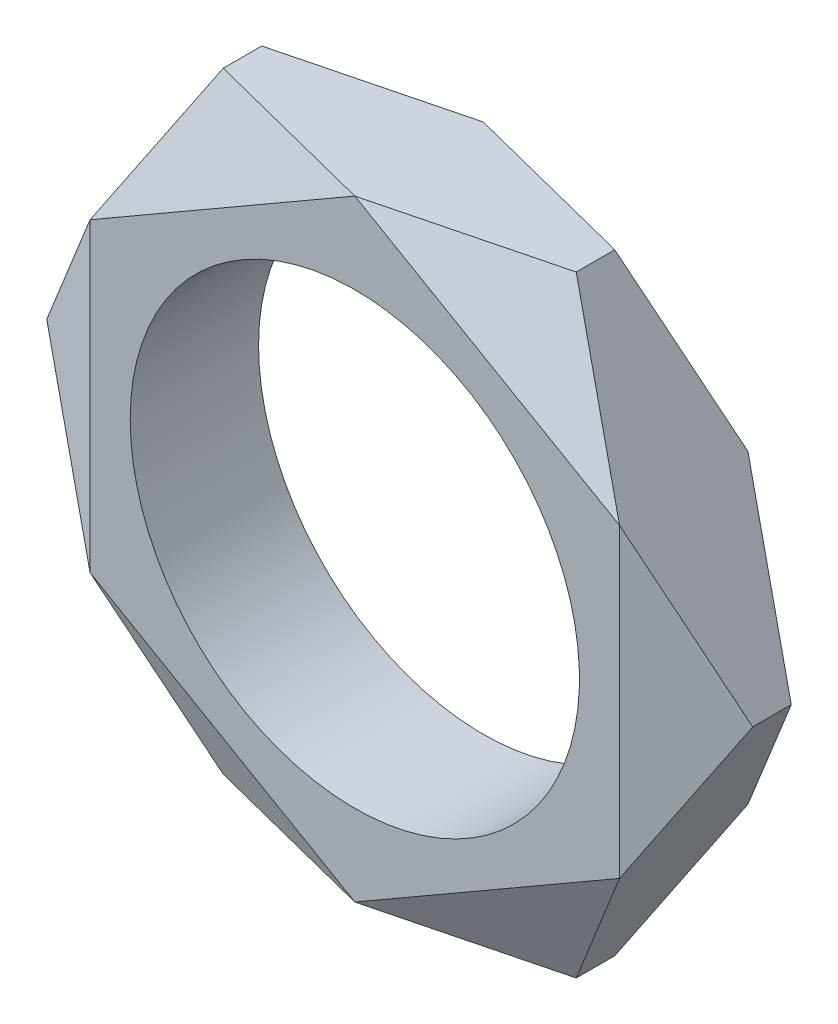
ISO-10303-21;
HEADER;
FILE_DESCRIPTION(('STEP AP214'),'2;1');
FILE_NAME('part.step','',(''),(''),'','','');
FILE_SCHEMA(('AUTOMOTIVE_DESIGN { 1 0 10303 214 1 1 1 1 }'));
ENDSEC;
DATA;
#1=APPLICATION_CONTEXT('core data for automotive mechanical design processes');
#2=APPLICATION_PROTOCOL_DEFINITION('international standard','automotive_design',2000,#1);
#3=PRODUCT_CONTEXT('',#1,'mechanical');
#4=PRODUCT('Part','Part','',(#3));
#5=PRODUCT_RELATED_PRODUCT_CATEGORY('part','',(#4));
#6=PRODUCT_DEFINITION_FORMATION('','',#4);
#7=PRODUCT_DEFINITION_CONTEXT('part definition',#1,'design');
#8=PRODUCT_DEFINITION('design','',#6,#7);
#9=PRODUCT_DEFINITION_SHAPE('','',#8);
#10=(LENGTH_UNIT() NAMED_UNIT(*) SI_UNIT(.MILLI.,.METRE.));
#11=(NAMED_UNIT(*) PLANE_ANGLE_UNIT() SI_UNIT($,.RADIAN.));
#12=(NAMED_UNIT(*) SI_UNIT($,.STERADIAN.) SOLID_ANGLE_UNIT());
#13=UNCERTAINTY_MEASURE_WITH_UNIT(LENGTH_MEASURE(1.E-05),#10,'distance_accuracy_value','');
#14=(GEOMETRIC_REPRESENTATION_CONTEXT(3) GLOBAL_UNCERTAINTY_ASSIGNED_CONTEXT((#13)) GLOBAL_UNIT_ASSIGNED_CONTEXT((#10,
#11,#12)) REPRESENTATION_CONTEXT('',''));
#15=CARTESIAN_POINT('',(0.,0.,0.));
#16=DIRECTION('',(0.,0.,1.));
#17=DIRECTION('',(1.,0.,0.));
#18=AXIS2_PLACEMENT_3D('',#15,#16,#17);
#19=CARTESIAN_POINT('',(2.74999999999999,4.76313972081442,2.));
#20=DIRECTION('',(0.,-1.,0.));
#21=DIRECTION('',(1.,0.,0.));
#22=AXIS2_PLACEMENT_3D('',#19,#20,#21);
#23=PLANE('',#22);
#24=DIRECTION('',(0.,0.,-1.));
#25=VECTOR('',#24,1.);
#26=CARTESIAN_POINT('',(2.74999999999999,4.76313972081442,2.));
#27=LINE('',#26,#25);
#28=CARTESIAN_POINT('',(2.74999999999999,4.76313972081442,1.3));
#29=VERTEX_POINT('',#28);
#30=CARTESIAN_POINT('',(2.74999999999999,4.76313972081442,0.7));
#31=VERTEX_POINT('',#30);
#32=EDGE_CURVE('E128',#29,#31,#27,.T.);
#33=ORIENTED_EDGE('',*,*,#32,.T.);
#34=DIRECTION('',(-0.969097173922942,0.,-0.246679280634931));
#35=VECTOR('',#34,1.);
#36=CARTESIAN_POINT('',(3.06077305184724,4.76313972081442,0.779105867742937));
#37=LINE('',#36,#35);
#38=CARTESIAN_POINT('',(0.,4.76313972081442,0.));
#39=VERTEX_POINT('',#38);
#40=EDGE_CURVE('E11',#31,#39,#37,.T.);
#41=ORIENTED_EDGE('',*,*,#40,.T.);
#42=DIRECTION('',(0.969097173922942,0.,-0.246679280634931));
#43=VECTOR('',#42,1.);
#44=CARTESIAN_POINT('',(2.10454827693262,4.76313972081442,-0.535703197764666));
#45=LINE('',#44,#43);
#46=CARTESIAN_POINT('',(-2.75,4.76313972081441,0.7));
#47=VERTEX_POINT('',#46);
#48=EDGE_CURVE('E228',#47,#39,#45,.T.);
#49=ORIENTED_EDGE('',*,*,#48,.F.);
#50=DIRECTION('',(0.,0.,-1.));
#51=VECTOR('',#50,1.);
#52=CARTESIAN_POINT('',(-2.75,4.76313972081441,2.));
#53=LINE('',#52,#51);
#54=CARTESIAN_POINT('',(-2.75,4.76313972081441,1.3));
#55=VERTEX_POINT('',#54);
#56=EDGE_CURVE('E136',#55,#47,#53,.T.);
#57=ORIENTED_EDGE('',*,*,#56,.F.);
#58=DIRECTION('',(-0.969097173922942,0.,-0.246679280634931));
#59=VECTOR('',#58,1.);
#60=CARTESIAN_POINT('',(2.58266066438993,4.76313972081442,2.6574045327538));
#61=LINE('',#60,#59);
#62=CARTESIAN_POINT('',(0.,4.76313972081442,2.));
#63=VERTEX_POINT('',#62);
#64=EDGE_CURVE('E169',#63,#55,#61,.T.);
#65=ORIENTED_EDGE('',*,*,#64,.F.);
#66=DIRECTION('',(-0.969097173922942,0.,0.246679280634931));
#67=VECTOR('',#66,1.);
#68=CARTESIAN_POINT('',(2.58266066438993,4.76313972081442,1.3425954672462));
#69=LINE('',#68,#67);
#70=EDGE_CURVE('E134',#29,#63,#69,.T.);
#71=ORIENTED_EDGE('',*,*,#70,.F.);
#72=EDGE_LOOP('',(#33,#41,#49,#57,#65,#71));
#73=FACE_BOUND('',#72,.T.);
#74=ADVANCED_FACE('F31',(#73),#23,.F.);
#75=CARTESIAN_POINT('',(2.74999999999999,4.76313972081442,2.));
#76=DIRECTION('',(-0.866025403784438,-0.500000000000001,0.));
#77=DIRECTION('',(0.500000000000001,-0.866025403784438,0.));
#78=AXIS2_PLACEMENT_3D('',#75,#76,#77);
#79=PLANE('',#78);
#80=DIRECTION('',(0.484548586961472,-0.839262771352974,0.246679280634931));
#81=VECTOR('',#80,1.);
#82=CARTESIAN_POINT('',(3.07272586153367,4.20416213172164,-0.535703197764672));
#83=LINE('',#82,#81);
#84=CARTESIAN_POINT('',(4.125,2.3815698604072,0.));
#85=VERTEX_POINT('',#84);
#86=CARTESIAN_POINT('',(5.5,0.,0.7));
#87=VERTEX_POINT('',#86);
#88=EDGE_CURVE('E131',#85,#87,#83,.T.);
#89=ORIENTED_EDGE('',*,*,#88,.F.);
#90=DIRECTION('',(-0.484548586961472,0.839262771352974,0.246679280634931));
#91=VECTOR('',#90,1.);
#92=CARTESIAN_POINT('',(2.59461347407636,5.03227707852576,0.779105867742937));
#93=LINE('',#92,#91);
#94=EDGE_CURVE('E39',#85,#31,#93,.T.);
#95=ORIENTED_EDGE('',*,*,#94,.T.);
#96=ORIENTED_EDGE('',*,*,#32,.F.);
#97=DIRECTION('',(-0.484548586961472,0.839262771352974,-0.246679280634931));
#98=VECTOR('',#97,1.);
#99=CARTESIAN_POINT('',(2.83366966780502,4.6182196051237,1.3425954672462));
#100=LINE('',#99,#98);
#101=CARTESIAN_POINT('',(4.12499999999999,2.38156986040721,2.));
#102=VERTEX_POINT('',#101);
#103=EDGE_CURVE('E178',#102,#29,#100,.T.);
#104=ORIENTED_EDGE('',*,*,#103,.F.);
#105=DIRECTION('',(-0.484548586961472,0.839262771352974,0.246679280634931));
#106=VECTOR('',#105,1.);
#107=CARTESIAN_POINT('',(2.83366966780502,4.6182196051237,2.65740453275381));
#108=LINE('',#107,#106);
#109=CARTESIAN_POINT('',(5.5,0.,1.3));
#110=VERTEX_POINT('',#109);
#111=EDGE_CURVE('E187',#110,#102,#108,.T.);
#112=ORIENTED_EDGE('',*,*,#111,.F.);
#113=DIRECTION('',(0.,0.,-1.));
#114=VECTOR('',#113,1.);
#115=CARTESIAN_POINT('',(5.5,0.,2.));
#116=LINE('',#115,#114);
#117=EDGE_CURVE('E135',#110,#87,#116,.T.);
#118=ORIENTED_EDGE('',*,*,#117,.T.);
#119=EDGE_LOOP('',(#89,#95,#96,#104,#112,#118));
#120=FACE_BOUND('',#119,.T.);
#121=ADVANCED_FACE('F126',(#120),#79,.F.);
#122=CARTESIAN_POINT('',(5.5,0.,0.));
#123=DIRECTION('',(0.,0.,-1.));
#124=DIRECTION('',(-1.,0.,0.));
#125=AXIS2_PLACEMENT_3D('',#122,#123,#124);
#126=PLANE('',#125);
#127=DIRECTION('',(-0.866025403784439,0.499999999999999,0.));
#128=VECTOR('',#127,1.);
#129=CARTESIAN_POINT('',(6.1875,1.19078493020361,0.));
#130=LINE('',#129,#128);
#131=EDGE_CURVE('E46',#85,#39,#130,.T.);
#132=ORIENTED_EDGE('',*,*,#131,.F.);
#133=DIRECTION('',(0.,-1.,0.));
#134=VECTOR('',#133,1.);
#135=CARTESIAN_POINT('',(4.125,0.,0.));
#136=LINE('',#135,#134);
#137=CARTESIAN_POINT('',(4.125,-2.38156986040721,0.));
#138=VERTEX_POINT('',#137);
#139=EDGE_CURVE('E197',#85,#138,#136,.T.);
#140=ORIENTED_EDGE('',*,*,#139,.T.);
#141=DIRECTION('',(-0.866025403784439,-0.499999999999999,0.));
#142=VECTOR('',#141,1.);
#143=CARTESIAN_POINT('',(6.1875,-1.19078493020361,0.));
#144=LINE('',#143,#142);
#145=CARTESIAN_POINT('',(0.,-4.76313972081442,0.));
#146=VERTEX_POINT('',#145);
#147=EDGE_CURVE('E200',#138,#146,#144,.T.);
#148=ORIENTED_EDGE('',*,*,#147,.T.);
#149=DIRECTION('',(-0.866025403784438,0.500000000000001,0.));
#150=VECTOR('',#149,1.);
#151=CARTESIAN_POINT('',(2.06249999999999,-5.95392465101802,0.));
#152=LINE('',#151,#150);
#153=CARTESIAN_POINT('',(-4.125,-2.38156986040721,0.));
#154=VERTEX_POINT('',#153);
#155=EDGE_CURVE('E209',#146,#154,#152,.T.);
#156=ORIENTED_EDGE('',*,*,#155,.T.);
#157=DIRECTION('',(0.,1.,0.));
#158=VECTOR('',#157,1.);
#159=CARTESIAN_POINT('',(-4.125,0.,0.));
#160=LINE('',#159,#158);
#161=CARTESIAN_POINT('',(-4.125,2.3815698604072,0.));
#162=VERTEX_POINT('',#161);
#163=EDGE_CURVE('E218',#154,#162,#160,.T.);
#164=ORIENTED_EDGE('',*,*,#163,.T.);
#165=DIRECTION('',(0.866025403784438,0.500000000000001,0.));
#166=VECTOR('',#165,1.);
#167=CARTESIAN_POINT('',(2.06249999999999,5.95392465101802,0.));
#168=LINE('',#167,#166);
#169=EDGE_CURVE('E226',#162,#39,#168,.T.);
#170=ORIENTED_EDGE('',*,*,#169,.T.);
#171=EDGE_LOOP('',(#132,#140,#148,#156,#164,#170));
#172=FACE_BOUND('',#171,.T.);
#173=CARTESIAN_POINT('',(0.,0.,0.));
#174=DIRECTION('',(0.,0.,-1.));
#175=DIRECTION('',(-1.,0.,0.));
#176=AXIS2_PLACEMENT_3D('',#173,#174,#175);
#177=CIRCLE('',#176,3.5);
#178=CARTESIAN_POINT('',(-3.5,0.,0.));
#179=VERTEX_POINT('',#178);
#180=EDGE_CURVE('E285',#179,#179,#177,.T.);
#181=ORIENTED_EDGE('',*,*,#180,.F.);
#182=EDGE_LOOP('',(#181));
#183=FACE_BOUND('',#182,.T.);
#184=ADVANCED_FACE('F236',(#172,#183),#126,.T.);
#185=CARTESIAN_POINT('',(2.74999999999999,-4.76313972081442,2.));
#186=DIRECTION('',(-0.866025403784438,0.500000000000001,0.));
#187=DIRECTION('',(-0.500000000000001,-0.866025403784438,0.));
#188=AXIS2_PLACEMENT_3D('',#185,#186,#187);
#189=PLANE('',#188);
#190=DIRECTION('',(-0.484548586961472,-0.839262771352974,0.246679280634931));
#191=VECTOR('',#190,1.);
#192=CARTESIAN_POINT('',(2.59461347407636,-5.03227707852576,0.779105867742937));
#193=LINE('',#192,#191);
#194=CARTESIAN_POINT('',(2.74999999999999,-4.76313972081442,0.7));
#195=VERTEX_POINT('',#194);
#196=EDGE_CURVE('E203',#138,#195,#193,.T.);
#197=ORIENTED_EDGE('',*,*,#196,.F.);
#198=DIRECTION('',(-0.484548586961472,-0.839262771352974,-0.246679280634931));
#199=VECTOR('',#198,1.);
#200=CARTESIAN_POINT('',(3.07272586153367,-4.20416213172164,-0.535703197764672));
#201=LINE('',#200,#199);
#202=EDGE_CURVE('E193',#87,#138,#201,.T.);
#203=ORIENTED_EDGE('',*,*,#202,.F.);
#204=ORIENTED_EDGE('',*,*,#117,.F.);
#205=DIRECTION('',(0.484548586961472,0.839262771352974,-0.246679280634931));
#206=VECTOR('',#205,1.);
#207=CARTESIAN_POINT('',(2.83366966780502,-4.6182196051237,2.65740453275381));
#208=LINE('',#207,#206);
#209=CARTESIAN_POINT('',(4.125,-2.38156986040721,2.));
#210=VERTEX_POINT('',#209);
#211=EDGE_CURVE('E184',#210,#110,#208,.T.);
#212=ORIENTED_EDGE('',*,*,#211,.F.);
#213=DIRECTION('',(0.484548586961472,0.839262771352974,0.246679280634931));
#214=VECTOR('',#213,1.);
#215=CARTESIAN_POINT('',(2.83366966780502,-4.6182196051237,1.3425954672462));
#216=LINE('',#215,#214);
#217=CARTESIAN_POINT('',(2.74999999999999,-4.76313972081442,1.3));
#218=VERTEX_POINT('',#217);
#219=EDGE_CURVE('E138',#218,#210,#216,.T.);
#220=ORIENTED_EDGE('',*,*,#219,.F.);
#221=DIRECTION('',(0.,0.,-1.));
#222=VECTOR('',#221,1.);
#223=CARTESIAN_POINT('',(2.74999999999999,-4.76313972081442,2.));
#224=LINE('',#223,#222);
#225=EDGE_CURVE('E277',#218,#195,#224,.T.);
#226=ORIENTED_EDGE('',*,*,#225,.T.);
#227=EDGE_LOOP('',(#197,#203,#204,#212,#220,#226));
#228=FACE_BOUND('',#227,.T.);
#229=ADVANCED_FACE('F33',(#228),#189,.F.);
#230=CARTESIAN_POINT('',(-2.75,4.76313972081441,2.));
#231=DIRECTION('',(0.866025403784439,-0.5,0.));
#232=DIRECTION('',(0.5,0.866025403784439,0.));
#233=AXIS2_PLACEMENT_3D('',#230,#231,#232);
#234=PLANE('',#233);
#235=DIRECTION('',(0.484548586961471,0.839262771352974,0.246679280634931));
#236=VECTOR('',#235,1.);
#237=CARTESIAN_POINT('',(-2.59461347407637,5.03227707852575,0.779105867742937));
#238=LINE('',#237,#236);
#239=EDGE_CURVE('E53',#162,#47,#238,.T.);
#240=ORIENTED_EDGE('',*,*,#239,.F.);
#241=DIRECTION('',(0.484548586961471,0.839262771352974,-0.246679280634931));
#242=VECTOR('',#241,1.);
#243=CARTESIAN_POINT('',(-3.07272586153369,4.20416213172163,-0.535703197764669));
#244=LINE('',#243,#242);
#245=CARTESIAN_POINT('',(-5.5,0.,0.7));
#246=VERTEX_POINT('',#245);
#247=EDGE_CURVE('E220',#246,#162,#244,.T.);
#248=ORIENTED_EDGE('',*,*,#247,.F.);
#249=DIRECTION('',(0.,0.,-1.));
#250=VECTOR('',#249,1.);
#251=CARTESIAN_POINT('',(-5.5,0.,2.));
#252=LINE('',#251,#250);
#253=CARTESIAN_POINT('',(-5.5,0.,1.3));
#254=VERTEX_POINT('',#253);
#255=EDGE_CURVE('E140',#254,#246,#252,.T.);
#256=ORIENTED_EDGE('',*,*,#255,.F.);
#257=DIRECTION('',(-0.484548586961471,-0.839262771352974,-0.246679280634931));
#258=VECTOR('',#257,1.);
#259=CARTESIAN_POINT('',(-2.83366966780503,4.61821960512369,2.6574045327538));
#260=LINE('',#259,#258);
#261=CARTESIAN_POINT('',(-4.125,2.3815698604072,2.));
#262=VERTEX_POINT('',#261);
#263=EDGE_CURVE('E160',#262,#254,#260,.T.);
#264=ORIENTED_EDGE('',*,*,#263,.F.);
#265=DIRECTION('',(-0.484548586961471,-0.839262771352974,0.246679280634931));
#266=VECTOR('',#265,1.);
#267=CARTESIAN_POINT('',(-2.83366966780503,4.61821960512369,1.3425954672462));
#268=LINE('',#267,#266);
#269=EDGE_CURVE('E172',#55,#262,#268,.T.);
#270=ORIENTED_EDGE('',*,*,#269,.F.);
#271=ORIENTED_EDGE('',*,*,#56,.T.);
#272=EDGE_LOOP('',(#240,#248,#256,#264,#270,#271));
#273=FACE_BOUND('',#272,.T.);
#274=ADVANCED_FACE('F244',(#273),#234,.F.);
#275=CARTESIAN_POINT('',(-5.5,0.,2.));
#276=DIRECTION('',(0.866025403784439,0.5,0.));
#277=DIRECTION('',(-0.5,0.866025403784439,0.));
#278=AXIS2_PLACEMENT_3D('',#275,#276,#277);
#279=PLANE('',#278);
#280=DIRECTION('',(-0.484548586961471,0.839262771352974,0.246679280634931));
#281=VECTOR('',#280,1.);
#282=CARTESIAN_POINT('',(-5.65538652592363,0.269137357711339,0.779105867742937));
#283=LINE('',#282,#281);
#284=EDGE_CURVE('E223',#154,#246,#283,.T.);
#285=ORIENTED_EDGE('',*,*,#284,.F.);
#286=DIRECTION('',(-0.484548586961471,0.839262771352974,-0.246679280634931));
#287=VECTOR('',#286,1.);
#288=CARTESIAN_POINT('',(-5.17727413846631,-0.558977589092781,-0.535703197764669));
#289=LINE('',#288,#287);
#290=CARTESIAN_POINT('',(-2.75,-4.76313972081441,0.7));
#291=VERTEX_POINT('',#290);
#292=EDGE_CURVE('E212',#291,#154,#289,.T.);
#293=ORIENTED_EDGE('',*,*,#292,.F.);
#294=DIRECTION('',(0.,0.,-1.));
#295=VECTOR('',#294,1.);
#296=CARTESIAN_POINT('',(-2.75,-4.76313972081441,2.));
#297=LINE('',#296,#295);
#298=CARTESIAN_POINT('',(-2.75,-4.76313972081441,1.3));
#299=VERTEX_POINT('',#298);
#300=EDGE_CURVE('E247',#299,#291,#297,.T.);
#301=ORIENTED_EDGE('',*,*,#300,.F.);
#302=DIRECTION('',(0.484548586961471,-0.839262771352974,-0.246679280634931));
#303=VECTOR('',#302,1.);
#304=CARTESIAN_POINT('',(-5.41633033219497,-0.144920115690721,2.6574045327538));
#305=LINE('',#304,#303);
#306=CARTESIAN_POINT('',(-4.125,-2.38156986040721,2.));
#307=VERTEX_POINT('',#306);
#308=EDGE_CURVE('E151',#307,#299,#305,.T.);
#309=ORIENTED_EDGE('',*,*,#308,.F.);
#310=DIRECTION('',(0.484548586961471,-0.839262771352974,0.246679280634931));
#311=VECTOR('',#310,1.);
#312=CARTESIAN_POINT('',(-5.41633033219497,-0.144920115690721,1.3425954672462));
#313=LINE('',#312,#311);
#314=EDGE_CURVE('E163',#254,#307,#313,.T.);
#315=ORIENTED_EDGE('',*,*,#314,.F.);
#316=ORIENTED_EDGE('',*,*,#255,.T.);
#317=EDGE_LOOP('',(#285,#293,#301,#309,#315,#316));
#318=FACE_BOUND('',#317,.T.);
#319=ADVANCED_FACE('F276',(#318),#279,.F.);
#320=CARTESIAN_POINT('',(-2.75,-4.76313972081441,2.));
#321=DIRECTION('',(0.,1.,0.));
#322=DIRECTION('',(-1.,0.,0.));
#323=AXIS2_PLACEMENT_3D('',#320,#321,#322);
#324=PLANE('',#323);
#325=DIRECTION('',(-0.969097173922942,0.,0.246679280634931));
#326=VECTOR('',#325,1.);
#327=CARTESIAN_POINT('',(-3.06077305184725,-4.76313972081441,0.779105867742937));
#328=LINE('',#327,#326);
#329=EDGE_CURVE('E215',#146,#291,#328,.T.);
#330=ORIENTED_EDGE('',*,*,#329,.F.);
#331=DIRECTION('',(-0.969097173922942,0.,-0.246679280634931));
#332=VECTOR('',#331,1.);
#333=CARTESIAN_POINT('',(-2.10454827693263,-4.76313972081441,-0.535703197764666));
#334=LINE('',#333,#332);
#335=EDGE_CURVE('E206',#195,#146,#334,.T.);
#336=ORIENTED_EDGE('',*,*,#335,.F.);
#337=ORIENTED_EDGE('',*,*,#225,.F.);
#338=DIRECTION('',(0.969097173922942,0.,-0.246679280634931));
#339=VECTOR('',#338,1.);
#340=CARTESIAN_POINT('',(-2.58266066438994,-4.76313972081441,2.6574045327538));
#341=LINE('',#340,#339);
#342=CARTESIAN_POINT('',(0.,-4.76313972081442,2.));
#343=VERTEX_POINT('',#342);
#344=EDGE_CURVE('E145',#343,#218,#341,.T.);
#345=ORIENTED_EDGE('',*,*,#344,.F.);
#346=DIRECTION('',(0.969097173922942,0.,0.246679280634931));
#347=VECTOR('',#346,1.);
#348=CARTESIAN_POINT('',(-2.58266066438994,-4.76313972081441,1.3425954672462));
#349=LINE('',#348,#347);
#350=EDGE_CURVE('E154',#299,#343,#349,.T.);
#351=ORIENTED_EDGE('',*,*,#350,.F.);
#352=ORIENTED_EDGE('',*,*,#300,.T.);
#353=EDGE_LOOP('',(#330,#336,#337,#345,#351,#352));
#354=FACE_BOUND('',#353,.T.);
#355=ADVANCED_FACE('F273',(#354),#324,.F.);
#356=CARTESIAN_POINT('',(5.5,0.,2.));
#357=DIRECTION('',(0.,0.,-1.));
#358=DIRECTION('',(-1.,0.,0.));
#359=AXIS2_PLACEMENT_3D('',#356,#357,#358);
#360=PLANE('',#359);
#361=DIRECTION('',(0.,-1.,0.));
#362=VECTOR('',#361,1.);
#363=CARTESIAN_POINT('',(4.125,0.,2.));
#364=LINE('',#363,#362);
#365=EDGE_CURVE('E190',#102,#210,#364,.T.);
#366=ORIENTED_EDGE('',*,*,#365,.F.);
#367=DIRECTION('',(0.866025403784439,-0.499999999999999,0.));
#368=VECTOR('',#367,1.);
#369=CARTESIAN_POINT('',(6.1875,1.19078493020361,2.));
#370=LINE('',#369,#368);
#371=EDGE_CURVE('E181',#63,#102,#370,.T.);
#372=ORIENTED_EDGE('',*,*,#371,.F.);
#373=DIRECTION('',(0.866025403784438,0.500000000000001,0.));
#374=VECTOR('',#373,1.);
#375=CARTESIAN_POINT('',(2.06249999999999,5.95392465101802,2.));
#376=LINE('',#375,#374);
#377=EDGE_CURVE('E175',#262,#63,#376,.T.);
#378=ORIENTED_EDGE('',*,*,#377,.F.);
#379=DIRECTION('',(0.,1.,0.));
#380=VECTOR('',#379,1.);
#381=CARTESIAN_POINT('',(-4.125,0.,2.));
#382=LINE('',#381,#380);
#383=EDGE_CURVE('E166',#307,#262,#382,.T.);
#384=ORIENTED_EDGE('',*,*,#383,.F.);
#385=DIRECTION('',(-0.866025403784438,0.500000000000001,0.));
#386=VECTOR('',#385,1.);
#387=CARTESIAN_POINT('',(2.06249999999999,-5.95392465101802,2.));
#388=LINE('',#387,#386);
#389=EDGE_CURVE('E157',#343,#307,#388,.T.);
#390=ORIENTED_EDGE('',*,*,#389,.F.);
#391=DIRECTION('',(-0.866025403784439,-0.499999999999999,0.));
#392=VECTOR('',#391,1.);
#393=CARTESIAN_POINT('',(6.1875,-1.19078493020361,2.));
#394=LINE('',#393,#392);
#395=EDGE_CURVE('E148',#210,#343,#394,.T.);
#396=ORIENTED_EDGE('',*,*,#395,.F.);
#397=EDGE_LOOP('',(#366,#372,#378,#384,#390,#396));
#398=FACE_BOUND('',#397,.T.);
#399=CARTESIAN_POINT('',(0.,0.,2.));
#400=DIRECTION('',(0.,0.,-1.));
#401=DIRECTION('',(-1.,0.,0.));
#402=AXIS2_PLACEMENT_3D('',#399,#400,#401);
#403=CIRCLE('',#402,3.5);
#404=CARTESIAN_POINT('',(-3.5,0.,2.));
#405=VERTEX_POINT('',#404);
#406=EDGE_CURVE('E280',#405,#405,#403,.F.);
#407=ORIENTED_EDGE('',*,*,#406,.F.);
#408=EDGE_LOOP('',(#407));
#409=FACE_BOUND('',#408,.T.);
#410=ADVANCED_FACE('F264',(#398,#409),#360,.F.);
#411=CARTESIAN_POINT('',(0.,0.,11.8994949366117));
#412=DIRECTION('',(0.,0.,-1.));
#413=DIRECTION('',(-1.,0.,0.));
#414=AXIS2_PLACEMENT_3D('',#411,#412,#413);
#415=CYLINDRICAL_SURFACE('',#414,3.5);
#416=CARTESIAN_POINT('',(-3.5,0.,2.));
#417=CARTESIAN_POINT('',(-3.5,0.,1.97916666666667));
#418=CARTESIAN_POINT('',(-3.5,0.,1.95833333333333));
#419=CARTESIAN_POINT('',(-3.5,0.,1.91666666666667));
#420=CARTESIAN_POINT('',(-3.5,0.,1.89583333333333));
#421=CARTESIAN_POINT('',(-3.5,0.,1.85416666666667));
#422=CARTESIAN_POINT('',(-3.5,0.,1.83333333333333));
#423=CARTESIAN_POINT('',(-3.5,0.,1.79166666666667));
#424=CARTESIAN_POINT('',(-3.5,0.,1.77083333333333));
#425=CARTESIAN_POINT('',(-3.5,0.,1.72916666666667));
#426=CARTESIAN_POINT('',(-3.5,0.,1.70833333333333));
#427=CARTESIAN_POINT('',(-3.5,0.,1.66666666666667));
#428=CARTESIAN_POINT('',(-3.5,0.,1.64583333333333));
#429=CARTESIAN_POINT('',(-3.5,0.,1.60416666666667));
#430=CARTESIAN_POINT('',(-3.5,0.,1.58333333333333));
#431=CARTESIAN_POINT('',(-3.5,0.,1.54166666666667));
#432=CARTESIAN_POINT('',(-3.5,0.,1.52083333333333));
#433=CARTESIAN_POINT('',(-3.5,0.,1.47916666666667));
#434=CARTESIAN_POINT('',(-3.5,0.,1.45833333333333));
#435=CARTESIAN_POINT('',(-3.5,0.,1.41666666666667));
#436=CARTESIAN_POINT('',(-3.5,0.,1.39583333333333));
#437=CARTESIAN_POINT('',(-3.5,0.,1.35416666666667));
#438=CARTESIAN_POINT('',(-3.5,0.,1.33333333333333));
#439=CARTESIAN_POINT('',(-3.5,0.,1.29166666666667));
#440=CARTESIAN_POINT('',(-3.5,0.,1.27083333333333));
#441=CARTESIAN_POINT('',(-3.5,0.,1.22916666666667));
#442=CARTESIAN_POINT('',(-3.5,0.,1.20833333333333));
#443=CARTESIAN_POINT('',(-3.5,0.,1.16666666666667));
#444=CARTESIAN_POINT('',(-3.5,0.,1.14583333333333));
#445=CARTESIAN_POINT('',(-3.5,0.,1.10416666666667));
#446=CARTESIAN_POINT('',(-3.5,0.,1.08333333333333));
#447=CARTESIAN_POINT('',(-3.5,0.,1.04166666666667));
#448=CARTESIAN_POINT('',(-3.5,0.,1.02083333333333));
#449=CARTESIAN_POINT('',(-3.5,0.,0.979166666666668));
#450=CARTESIAN_POINT('',(-3.5,0.,0.958333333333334));
#451=CARTESIAN_POINT('',(-3.5,0.,0.916666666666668));
#452=CARTESIAN_POINT('',(-3.5,0.,0.895833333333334));
#453=CARTESIAN_POINT('',(-3.5,0.,0.854166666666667));
#454=CARTESIAN_POINT('',(-3.5,0.,0.833333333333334));
#455=CARTESIAN_POINT('',(-3.5,0.,0.791666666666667));
#456=CARTESIAN_POINT('',(-3.5,0.,0.770833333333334));
#457=CARTESIAN_POINT('',(-3.5,0.,0.729166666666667));
#458=CARTESIAN_POINT('',(-3.5,0.,0.708333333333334));
#459=CARTESIAN_POINT('',(-3.5,0.,0.666666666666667));
#460=CARTESIAN_POINT('',(-3.5,0.,0.645833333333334));
#461=CARTESIAN_POINT('',(-3.5,0.,0.604166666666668));
#462=CARTESIAN_POINT('',(-3.5,0.,0.583333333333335));
#463=CARTESIAN_POINT('',(-3.5,0.,0.541666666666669));
#464=CARTESIAN_POINT('',(-3.5,0.,0.520833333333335));
#465=CARTESIAN_POINT('',(-3.5,0.,0.479166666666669));
#466=CARTESIAN_POINT('',(-3.5,0.,0.458333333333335));
#467=CARTESIAN_POINT('',(-3.5,0.,0.416666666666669));
#468=CARTESIAN_POINT('',(-3.5,0.,0.395833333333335));
#469=CARTESIAN_POINT('',(-3.5,0.,0.354166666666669));
#470=CARTESIAN_POINT('',(-3.5,0.,0.333333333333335));
#471=CARTESIAN_POINT('',(-3.5,0.,0.291666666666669));
#472=CARTESIAN_POINT('',(-3.5,0.,0.270833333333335));
#473=CARTESIAN_POINT('',(-3.5,0.,0.229166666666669));
#474=CARTESIAN_POINT('',(-3.5,0.,0.208333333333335));
#475=CARTESIAN_POINT('',(-3.5,0.,0.166666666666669));
#476=CARTESIAN_POINT('',(-3.5,0.,0.145833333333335));
#477=CARTESIAN_POINT('',(-3.5,0.,0.104166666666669));
#478=CARTESIAN_POINT('',(-3.5,0.,0.0833333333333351));
#479=CARTESIAN_POINT('',(-3.5,0.,0.0416666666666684));
#480=CARTESIAN_POINT('',(-3.5,0.,0.0208333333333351));
#481=CARTESIAN_POINT('',(-3.5,0.,0.));
#482=B_SPLINE_CURVE_WITH_KNOTS('',3,(#416,#417,#418,#419,#420,#421,#422,#423,#424,#425,#426,
#427,#428,#429,#430,#431,#432,#433,#434,#435,#436,#437,#438,#439,#440,#441,#442,#443,#444,#445,
#446,#447,#448,#449,#450,#451,#452,#453,#454,#455,#456,#457,#458,#459,#460,#461,#462,#463,#464,
#465,#466,#467,#468,#469,#470,#471,#472,#473,#474,#475,#476,#477,#478,#479,#480,#481),
.UNSPECIFIED.,.F.,.F.,(4,2,2,2,2,2,2,2,2,2,2,2,2,2,2,2,2,2,2,2,2,2,2,2,2,2,2,2,2,2,2,2,4),(0.,
0.0625000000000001,0.125,0.1875,0.25,0.3125,0.375,0.4375,0.5,0.562499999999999,
0.624999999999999,0.687499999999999,0.749999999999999,0.812499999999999,0.874999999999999,
0.937499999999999,0.999999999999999,1.0625,1.125,1.1875,1.25,1.3125,1.375,1.4375,1.5,1.5625,
1.625,1.6875,1.75,1.8125,1.875,1.9375,2.),.UNSPECIFIED.);
#483=EDGE_CURVE('BSEAM289',#405,#179,#482,.T.);
#484=ORIENTED_EDGE('',*,*,#406,.T.);
#485=ORIENTED_EDGE('',*,*,#180,.T.);
#486=ORIENTED_EDGE('',*,*,#483,.T.);
#487=ORIENTED_EDGE('',*,*,#483,.F.);
#488=EDGE_LOOP('',(#484,#486,#485,#487));
#489=FACE_BOUND('',#488,.T.);
#490=ADVANCED_FACE('F289',(#489),#415,.F.);
#491=CARTESIAN_POINT('',(-0.0229166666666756,-4.77107828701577,2.00233333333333));
#492=DIRECTION('',(0.226841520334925,-0.39290103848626,0.891163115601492));
#493=DIRECTION('',(0.,-0.915016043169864,-0.40341745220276));
#494=AXIS2_PLACEMENT_3D('',#491,#492,#493);
#495=PLANE('',#494);
#496=ORIENTED_EDGE('',*,*,#344,.T.);
#497=ORIENTED_EDGE('',*,*,#219,.T.);
#498=ORIENTED_EDGE('',*,*,#395,.T.);
#499=EDGE_LOOP('',(#496,#497,#498));
#500=FACE_BOUND('',#499,.T.);
#501=ADVANCED_FACE('F268',(#500),#495,.T.);
#502=CARTESIAN_POINT('',(-4.14333333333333,-2.36569272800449,2.00233333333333));
#503=DIRECTION('',(-0.226841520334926,-0.39290103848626,0.891163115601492));
#504=DIRECTION('',(0.,-0.915016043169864,-0.40341745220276));
#505=AXIS2_PLACEMENT_3D('',#502,#503,#504);
#506=PLANE('',#505);
#507=ORIENTED_EDGE('',*,*,#389,.T.);
#508=ORIENTED_EDGE('',*,*,#308,.T.);
#509=ORIENTED_EDGE('',*,*,#350,.T.);
#510=EDGE_LOOP('',(#507,#508,#509));
#511=FACE_BOUND('',#510,.T.);
#512=ADVANCED_FACE('F270',(#511),#506,.T.);
#513=CARTESIAN_POINT('',(-4.12041666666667,2.40538555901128,2.00233333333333));
#514=DIRECTION('',(-0.453683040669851,0.,0.891163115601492));
#515=DIRECTION('',(0.891163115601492,0.,0.453683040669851));
#516=AXIS2_PLACEMENT_3D('',#513,#514,#515);
#517=PLANE('',#516);
#518=ORIENTED_EDGE('',*,*,#383,.T.);
#519=ORIENTED_EDGE('',*,*,#263,.T.);
#520=ORIENTED_EDGE('',*,*,#314,.T.);
#521=EDGE_LOOP('',(#518,#519,#520));
#522=FACE_BOUND('',#521,.T.);
#523=ADVANCED_FACE('F249',(#522),#517,.T.);
#524=CARTESIAN_POINT('',(0.0229166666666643,4.77107828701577,2.00233333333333));
#525=DIRECTION('',(-0.226841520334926,0.39290103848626,0.891163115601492));
#526=DIRECTION('',(0.,-0.915016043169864,0.40341745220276));
#527=AXIS2_PLACEMENT_3D('',#524,#525,#526);
#528=PLANE('',#527);
#529=ORIENTED_EDGE('',*,*,#377,.T.);
#530=ORIENTED_EDGE('',*,*,#64,.T.);
#531=ORIENTED_EDGE('',*,*,#269,.T.);
#532=EDGE_LOOP('',(#529,#530,#531));
#533=FACE_BOUND('',#532,.T.);
#534=ADVANCED_FACE('F253',(#533),#528,.T.);
#535=CARTESIAN_POINT('',(4.14333333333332,2.3656927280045,2.00233333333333));
#536=DIRECTION('',(0.226841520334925,0.39290103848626,0.891163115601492));
#537=DIRECTION('',(0.,-0.915016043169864,0.40341745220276));
#538=AXIS2_PLACEMENT_3D('',#535,#536,#537);
#539=PLANE('',#538);
#540=ORIENTED_EDGE('',*,*,#371,.T.);
#541=ORIENTED_EDGE('',*,*,#103,.T.);
#542=ORIENTED_EDGE('',*,*,#70,.T.);
#543=EDGE_LOOP('',(#540,#541,#542));
#544=FACE_BOUND('',#543,.T.);
#545=ADVANCED_FACE('F256',(#544),#539,.T.);
#546=CARTESIAN_POINT('',(4.12041666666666,-2.40538555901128,2.00233333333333));
#547=DIRECTION('',(0.45368304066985,0.,0.891163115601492));
#548=DIRECTION('',(0.891163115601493,0.,-0.45368304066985));
#549=AXIS2_PLACEMENT_3D('',#546,#547,#548);
#550=PLANE('',#549);
#551=ORIENTED_EDGE('',*,*,#365,.T.);
#552=ORIENTED_EDGE('',*,*,#211,.T.);
#553=ORIENTED_EDGE('',*,*,#111,.T.);
#554=EDGE_LOOP('',(#551,#552,#553));
#555=FACE_BOUND('',#554,.T.);
#556=ADVANCED_FACE('F262',(#555),#550,.T.);
#557=CARTESIAN_POINT('',(5.50916666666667,0.,0.704666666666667));
#558=DIRECTION('',(0.45368304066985,0.,-0.891163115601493));
#559=DIRECTION('',(-0.891163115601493,0.,-0.45368304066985));
#560=AXIS2_PLACEMENT_3D('',#557,#558,#559);
#561=PLANE('',#560);
#562=ORIENTED_EDGE('',*,*,#88,.T.);
#563=ORIENTED_EDGE('',*,*,#202,.T.);
#564=ORIENTED_EDGE('',*,*,#139,.F.);
#565=EDGE_LOOP('',(#562,#563,#564));
#566=FACE_BOUND('',#565,.T.);
#567=ADVANCED_FACE('F328',(#566),#561,.T.);
#568=CARTESIAN_POINT('',(2.75458333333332,-4.77107828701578,0.704666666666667));
#569=DIRECTION('',(0.226841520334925,-0.39290103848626,-0.891163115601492));
#570=DIRECTION('',(0.,0.915016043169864,-0.40341745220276));
#571=AXIS2_PLACEMENT_3D('',#568,#569,#570);
#572=PLANE('',#571);
#573=ORIENTED_EDGE('',*,*,#147,.F.);
#574=ORIENTED_EDGE('',*,*,#196,.T.);
#575=ORIENTED_EDGE('',*,*,#335,.T.);
#576=EDGE_LOOP('',(#573,#574,#575));
#577=FACE_BOUND('',#576,.T.);
#578=ADVANCED_FACE('F331',(#577),#572,.T.);
#579=CARTESIAN_POINT('',(-2.75458333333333,-4.77107828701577,0.704666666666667));
#580=DIRECTION('',(-0.226841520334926,-0.392901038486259,-0.891163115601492));
#581=DIRECTION('',(0.,0.915016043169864,-0.40341745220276));
#582=AXIS2_PLACEMENT_3D('',#579,#580,#581);
#583=PLANE('',#582);
#584=ORIENTED_EDGE('',*,*,#155,.F.);
#585=ORIENTED_EDGE('',*,*,#329,.T.);
#586=ORIENTED_EDGE('',*,*,#292,.T.);
#587=EDGE_LOOP('',(#584,#585,#586));
#588=FACE_BOUND('',#587,.T.);
#589=ADVANCED_FACE('F335',(#588),#583,.T.);
#590=CARTESIAN_POINT('',(-5.50916666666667,0.,0.704666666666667));
#591=DIRECTION('',(-0.453683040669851,0.,-0.891163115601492));
#592=DIRECTION('',(-0.891163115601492,0.,0.453683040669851));
#593=AXIS2_PLACEMENT_3D('',#590,#591,#592);
#594=PLANE('',#593);
#595=ORIENTED_EDGE('',*,*,#163,.F.);
#596=ORIENTED_EDGE('',*,*,#284,.T.);
#597=ORIENTED_EDGE('',*,*,#247,.T.);
#598=EDGE_LOOP('',(#595,#596,#597));
#599=FACE_BOUND('',#598,.T.);
#600=ADVANCED_FACE('F242',(#599),#594,.T.);
#601=CARTESIAN_POINT('',(-2.75458333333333,4.77107828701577,0.704666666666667));
#602=DIRECTION('',(-0.226841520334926,0.392901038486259,-0.891163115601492));
#603=DIRECTION('',(0.,0.915016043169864,0.40341745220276));
#604=AXIS2_PLACEMENT_3D('',#601,#602,#603);
#605=PLANE('',#604);
#606=ORIENTED_EDGE('',*,*,#169,.F.);
#607=ORIENTED_EDGE('',*,*,#239,.T.);
#608=ORIENTED_EDGE('',*,*,#48,.T.);
#609=EDGE_LOOP('',(#606,#607,#608));
#610=FACE_BOUND('',#609,.T.);
#611=ADVANCED_FACE('F234',(#610),#605,.T.);
#612=CARTESIAN_POINT('',(2.75458333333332,4.77107828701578,0.704666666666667));
#613=DIRECTION('',(-0.226841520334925,-0.39290103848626,0.891163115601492));
#614=DIRECTION('',(0.,-0.915016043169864,-0.40341745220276));
#615=AXIS2_PLACEMENT_3D('',#612,#613,#614);
#616=PLANE('',#615);
#617=ORIENTED_EDGE('',*,*,#94,.F.);
#618=ORIENTED_EDGE('',*,*,#131,.T.);
#619=ORIENTED_EDGE('',*,*,#40,.F.);
#620=EDGE_LOOP('',(#617,#618,#619));
#621=FACE_BOUND('',#620,.T.);
#622=ADVANCED_FACE('F118',(#621),#616,.F.);
#623=CLOSED_SHELL('',(#74,#121,#184,#229,#274,#319,#355,#410,#490,#501,#512,#523,#534,#545,#556,
#567,#578,#589,#600,#611,#622));
#624=MANIFOLD_SOLID_BREP('B2',#623);
#625=ADVANCED_BREP_SHAPE_REPRESENTATION('',(#18,#624),#14);
#626=SHAPE_DEFINITION_REPRESENTATION(#9,#625);
ENDSEC;
END-ISO-10303-21;
